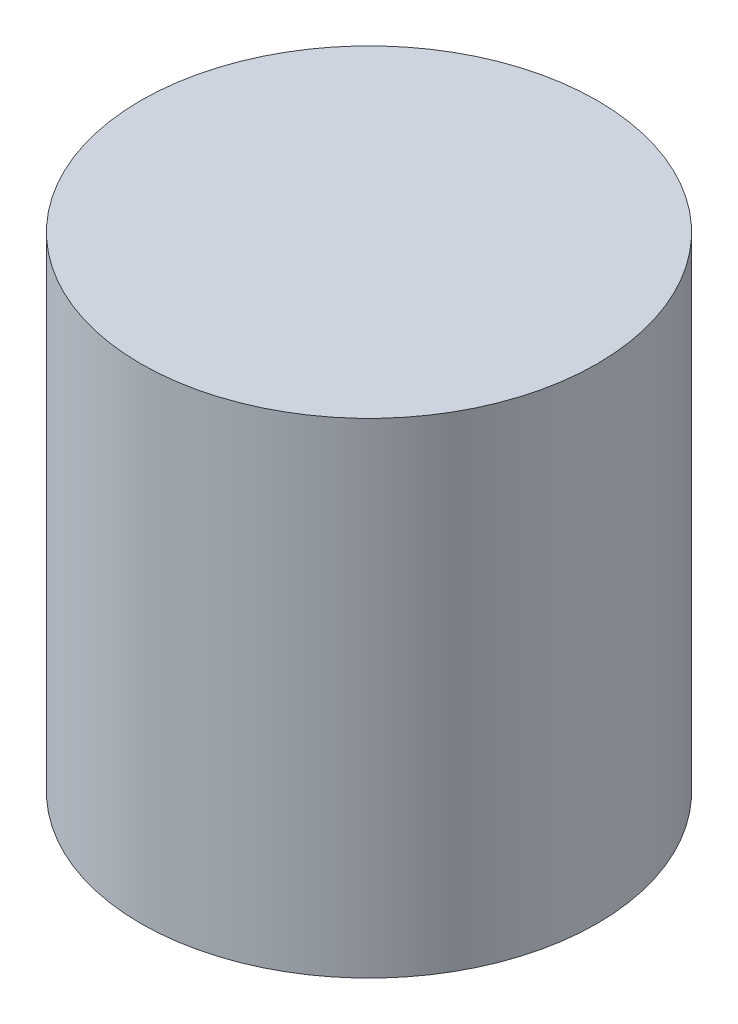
ISO-10303-21;
HEADER;
FILE_DESCRIPTION(('STEP AP214'),'2;1');
FILE_NAME('part.step','',(''),(''),'','','');
FILE_SCHEMA(('AUTOMOTIVE_DESIGN { 1 0 10303 214 1 1 1 1 }'));
ENDSEC;
DATA;
#1=APPLICATION_CONTEXT('core data for automotive mechanical design processes');
#2=APPLICATION_PROTOCOL_DEFINITION('international standard','automotive_design',2000,#1);
#3=PRODUCT_CONTEXT('',#1,'mechanical');
#4=PRODUCT('Part','Part','',(#3));
#5=PRODUCT_RELATED_PRODUCT_CATEGORY('part','',(#4));
#6=PRODUCT_DEFINITION_FORMATION('','',#4);
#7=PRODUCT_DEFINITION_CONTEXT('part definition',#1,'design');
#8=PRODUCT_DEFINITION('design','',#6,#7);
#9=PRODUCT_DEFINITION_SHAPE('','',#8);
#10=(LENGTH_UNIT() NAMED_UNIT(*) SI_UNIT(.MILLI.,.METRE.));
#11=(NAMED_UNIT(*) PLANE_ANGLE_UNIT() SI_UNIT($,.RADIAN.));
#12=(NAMED_UNIT(*) SI_UNIT($,.STERADIAN.) SOLID_ANGLE_UNIT());
#13=UNCERTAINTY_MEASURE_WITH_UNIT(LENGTH_MEASURE(1.E-05),#10,'distance_accuracy_value','');
#14=(GEOMETRIC_REPRESENTATION_CONTEXT(3) GLOBAL_UNCERTAINTY_ASSIGNED_CONTEXT((#13)) GLOBAL_UNIT_ASSIGNED_CONTEXT((#10,
#11,#12)) REPRESENTATION_CONTEXT('',''));
#15=CARTESIAN_POINT('',(0.,0.,0.));
#16=DIRECTION('',(0.,0.,1.));
#17=DIRECTION('',(1.,0.,0.));
#18=AXIS2_PLACEMENT_3D('',#15,#16,#17);
#19=CARTESIAN_POINT('',(0.,8.5,0.));
#20=DIRECTION('',(0.,-1.,0.));
#21=DIRECTION('',(0.,0.,-1.));
#22=AXIS2_PLACEMENT_3D('',#19,#20,#21);
#23=CYLINDRICAL_SURFACE('',#22,4.);
#24=CARTESIAN_POINT('',(0.,0.,0.));
#25=DIRECTION('',(0.,1.,0.));
#26=DIRECTION('',(0.,0.,1.));
#27=AXIS2_PLACEMENT_3D('',#24,#25,#26);
#28=CIRCLE('',#27,4.);
#29=CARTESIAN_POINT('',(0.,0.,4.));
#30=VERTEX_POINT('',#29);
#31=EDGE_CURVE('E10',#30,#30,#28,.T.);
#32=ORIENTED_EDGE('',*,*,#31,.T.);
#33=EDGE_LOOP('',(#32));
#34=FACE_BOUND('',#33,.T.);
#35=CARTESIAN_POINT('',(0.,8.5,0.));
#36=DIRECTION('',(0.,1.,0.));
#37=DIRECTION('',(0.,0.,1.));
#38=AXIS2_PLACEMENT_3D('',#35,#36,#37);
#39=CIRCLE('',#38,4.);
#40=CARTESIAN_POINT('',(0.,8.5,4.));
#41=VERTEX_POINT('',#40);
#42=EDGE_CURVE('E22',#41,#41,#39,.T.);
#43=ORIENTED_EDGE('',*,*,#42,.F.);
#44=EDGE_LOOP('',(#43));
#45=FACE_BOUND('',#44,.T.);
#46=ADVANCED_FACE('F15',(#34,#45),#23,.T.);
#47=CARTESIAN_POINT('',(0.,8.5,0.));
#48=DIRECTION('',(0.,1.,0.));
#49=DIRECTION('',(0.,0.,1.));
#50=AXIS2_PLACEMENT_3D('',#47,#48,#49);
#51=PLANE('',#50);
#52=ORIENTED_EDGE('',*,*,#42,.T.);
#53=EDGE_LOOP('',(#52));
#54=FACE_BOUND('',#53,.T.);
#55=ADVANCED_FACE('F28',(#54),#51,.T.);
#56=CARTESIAN_POINT('',(0.,0.,0.));
#57=DIRECTION('',(0.,1.,0.));
#58=DIRECTION('',(0.,0.,1.));
#59=AXIS2_PLACEMENT_3D('',#56,#57,#58);
#60=PLANE('',#59);
#61=ORIENTED_EDGE('',*,*,#31,.F.);
#62=EDGE_LOOP('',(#61));
#63=FACE_BOUND('',#62,.T.);
#64=ADVANCED_FACE('F17',(#63),#60,.F.);
#65=CLOSED_SHELL('',(#46,#55,#64));
#66=MANIFOLD_SOLID_BREP('B1',#65);
#67=ADVANCED_BREP_SHAPE_REPRESENTATION('',(#18,#66),#14);
#68=SHAPE_DEFINITION_REPRESENTATION(#9,#67);
ENDSEC;
END-ISO-10303-21;
